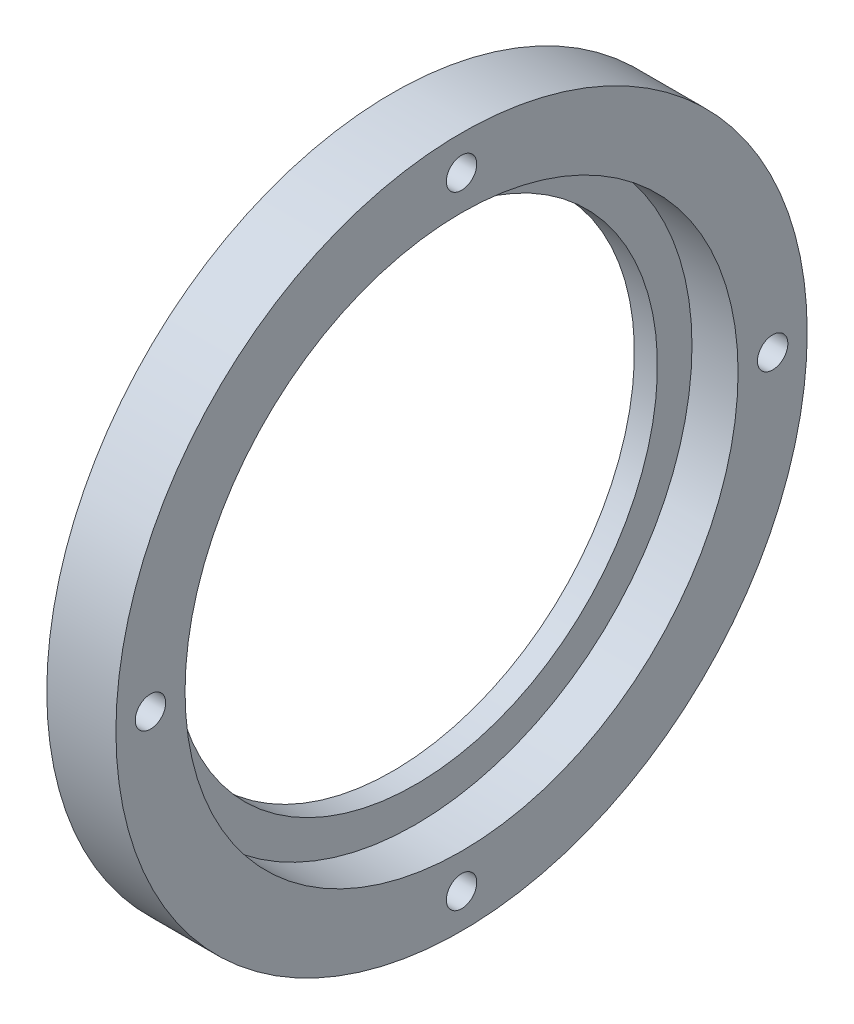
ISO-10303-21;
HEADER;
FILE_DESCRIPTION(('STEP AP214'),'2;1');
FILE_NAME('part.step','',(''),(''),'','','');
FILE_SCHEMA(('AUTOMOTIVE_DESIGN { 1 0 10303 214 1 1 1 1 }'));
ENDSEC;
DATA;
#1=APPLICATION_CONTEXT('core data for automotive mechanical design processes');
#2=APPLICATION_PROTOCOL_DEFINITION('international standard','automotive_design',2000,#1);
#3=PRODUCT_CONTEXT('',#1,'mechanical');
#4=PRODUCT('Part','Part','',(#3));
#5=PRODUCT_RELATED_PRODUCT_CATEGORY('part','',(#4));
#6=PRODUCT_DEFINITION_FORMATION('','',#4);
#7=PRODUCT_DEFINITION_CONTEXT('part definition',#1,'design');
#8=PRODUCT_DEFINITION('design','',#6,#7);
#9=PRODUCT_DEFINITION_SHAPE('','',#8);
#10=(LENGTH_UNIT() NAMED_UNIT(*) SI_UNIT(.MILLI.,.METRE.));
#11=(NAMED_UNIT(*) PLANE_ANGLE_UNIT() SI_UNIT($,.RADIAN.));
#12=(NAMED_UNIT(*) SI_UNIT($,.STERADIAN.) SOLID_ANGLE_UNIT());
#13=UNCERTAINTY_MEASURE_WITH_UNIT(LENGTH_MEASURE(1.E-05),#10,'distance_accuracy_value','');
#14=(GEOMETRIC_REPRESENTATION_CONTEXT(3) GLOBAL_UNCERTAINTY_ASSIGNED_CONTEXT((#13)) GLOBAL_UNIT_ASSIGNED_CONTEXT((#10,
#11,#12)) REPRESENTATION_CONTEXT('',''));
#15=CARTESIAN_POINT('',(0.,0.,0.));
#16=DIRECTION('',(0.,0.,1.));
#17=DIRECTION('',(1.,0.,0.));
#18=AXIS2_PLACEMENT_3D('',#15,#16,#17);
#19=CARTESIAN_POINT('',(-16.7088779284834,0.,0.));
#20=DIRECTION('',(-1.,0.,0.));
#21=DIRECTION('',(0.,0.,1.));
#22=AXIS2_PLACEMENT_3D('',#19,#20,#21);
#23=CYLINDRICAL_SURFACE('',#22,52.5);
#24=CARTESIAN_POINT('',(5.,0.,0.));
#25=DIRECTION('',(-1.,0.,0.));
#26=DIRECTION('',(0.,0.,1.));
#27=AXIS2_PLACEMENT_3D('',#24,#25,#26);
#28=CIRCLE('',#27,52.5);
#29=CARTESIAN_POINT('',(5.,0.,52.5));
#30=VERTEX_POINT('',#29);
#31=EDGE_CURVE('E52',#30,#30,#28,.T.);
#32=ORIENTED_EDGE('',*,*,#31,.F.);
#33=EDGE_LOOP('',(#32));
#34=FACE_BOUND('',#33,.T.);
#35=CARTESIAN_POINT('',(0.,0.,0.));
#36=DIRECTION('',(-1.,0.,0.));
#37=DIRECTION('',(0.,0.,1.));
#38=AXIS2_PLACEMENT_3D('',#35,#36,#37);
#39=CIRCLE('',#38,52.5);
#40=CARTESIAN_POINT('',(0.,0.,52.5));
#41=VERTEX_POINT('',#40);
#42=EDGE_CURVE('E10',#41,#41,#39,.T.);
#43=ORIENTED_EDGE('',*,*,#42,.T.);
#44=EDGE_LOOP('',(#43));
#45=FACE_BOUND('',#44,.T.);
#46=ADVANCED_FACE('F30',(#34,#45),#23,.F.);
#47=CARTESIAN_POINT('',(0.,52.5,0.));
#48=DIRECTION('',(1.,0.,0.));
#49=DIRECTION('',(0.,0.,-1.));
#50=AXIS2_PLACEMENT_3D('',#47,#48,#49);
#51=PLANE('',#50);
#52=CARTESIAN_POINT('',(0.,67.5,0.));
#53=DIRECTION('',(-1.,0.,0.));
#54=DIRECTION('',(0.,0.,1.));
#55=AXIS2_PLACEMENT_3D('',#52,#53,#54);
#56=CIRCLE('',#55,3.29999999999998);
#57=CARTESIAN_POINT('',(0.,67.5,3.29999999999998));
#58=VERTEX_POINT('',#57);
#59=EDGE_CURVE('E73',#58,#58,#56,.T.);
#60=ORIENTED_EDGE('',*,*,#59,.F.);
#61=EDGE_LOOP('',(#60));
#62=FACE_BOUND('',#61,.T.);
#63=CARTESIAN_POINT('',(0.,0.,67.5));
#64=DIRECTION('',(-1.,0.,0.));
#65=DIRECTION('',(0.,0.,1.));
#66=AXIS2_PLACEMENT_3D('',#63,#64,#65);
#67=CIRCLE('',#66,3.29999999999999);
#68=CARTESIAN_POINT('',(0.,0.,70.8));
#69=VERTEX_POINT('',#68);
#70=EDGE_CURVE('E67',#69,#69,#67,.T.);
#71=ORIENTED_EDGE('',*,*,#70,.F.);
#72=EDGE_LOOP('',(#71));
#73=FACE_BOUND('',#72,.T.);
#74=CARTESIAN_POINT('',(0.,-67.5,0.));
#75=DIRECTION('',(-1.,0.,0.));
#76=DIRECTION('',(0.,0.,1.));
#77=AXIS2_PLACEMENT_3D('',#74,#75,#76);
#78=CIRCLE('',#77,3.29999999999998);
#79=CARTESIAN_POINT('',(0.,-67.5,3.29999999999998));
#80=VERTEX_POINT('',#79);
#81=EDGE_CURVE('E61',#80,#80,#78,.T.);
#82=ORIENTED_EDGE('',*,*,#81,.F.);
#83=EDGE_LOOP('',(#82));
#84=FACE_BOUND('',#83,.T.);
#85=CARTESIAN_POINT('',(0.,0.,-67.5));
#86=DIRECTION('',(-1.,0.,0.));
#87=DIRECTION('',(0.,0.,1.));
#88=AXIS2_PLACEMENT_3D('',#85,#86,#87);
#89=CIRCLE('',#88,3.29999999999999);
#90=CARTESIAN_POINT('',(0.,0.,-64.2));
#91=VERTEX_POINT('',#90);
#92=EDGE_CURVE('E55',#91,#91,#89,.T.);
#93=ORIENTED_EDGE('',*,*,#92,.F.);
#94=EDGE_LOOP('',(#93));
#95=FACE_BOUND('',#94,.T.);
#96=ORIENTED_EDGE('',*,*,#42,.F.);
#97=EDGE_LOOP('',(#96));
#98=FACE_BOUND('',#97,.T.);
#99=CARTESIAN_POINT('',(0.,0.,0.));
#100=DIRECTION('',(-1.,0.,0.));
#101=DIRECTION('',(0.,0.,1.));
#102=AXIS2_PLACEMENT_3D('',#99,#100,#101);
#103=CIRCLE('',#102,75.);
#104=CARTESIAN_POINT('',(0.,0.,75.));
#105=VERTEX_POINT('',#104);
#106=EDGE_CURVE('E36',#105,#105,#103,.T.);
#107=ORIENTED_EDGE('',*,*,#106,.T.);
#108=EDGE_LOOP('',(#107));
#109=FACE_BOUND('',#108,.T.);
#110=ADVANCED_FACE('F90',(#62,#73,#84,#95,#98,#109),#51,.F.);
#111=CARTESIAN_POINT('',(-16.7088779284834,0.,0.));
#112=DIRECTION('',(-1.,0.,0.));
#113=DIRECTION('',(0.,0.,1.));
#114=AXIS2_PLACEMENT_3D('',#111,#112,#113);
#115=CYLINDRICAL_SURFACE('',#114,75.);
#116=ORIENTED_EDGE('',*,*,#106,.F.);
#117=EDGE_LOOP('',(#116));
#118=FACE_BOUND('',#117,.T.);
#119=CARTESIAN_POINT('',(15.,0.,0.));
#120=DIRECTION('',(-1.,0.,0.));
#121=DIRECTION('',(0.,0.,1.));
#122=AXIS2_PLACEMENT_3D('',#119,#120,#121);
#123=CIRCLE('',#122,75.);
#124=CARTESIAN_POINT('',(15.,0.,75.));
#125=VERTEX_POINT('',#124);
#126=EDGE_CURVE('E40',#125,#125,#123,.T.);
#127=ORIENTED_EDGE('',*,*,#126,.T.);
#128=EDGE_LOOP('',(#127));
#129=FACE_BOUND('',#128,.T.);
#130=ADVANCED_FACE('F93',(#118,#129),#115,.T.);
#131=CARTESIAN_POINT('',(15.,75.,0.));
#132=DIRECTION('',(-1.,0.,0.));
#133=DIRECTION('',(0.,0.,1.));
#134=AXIS2_PLACEMENT_3D('',#131,#132,#133);
#135=PLANE('',#134);
#136=CARTESIAN_POINT('',(15.,67.5,0.));
#137=DIRECTION('',(-1.,0.,0.));
#138=DIRECTION('',(0.,0.,1.));
#139=AXIS2_PLACEMENT_3D('',#136,#137,#138);
#140=CIRCLE('',#139,3.3);
#141=CARTESIAN_POINT('',(15.,67.5,3.3));
#142=VERTEX_POINT('',#141);
#143=EDGE_CURVE('E76',#142,#142,#140,.T.);
#144=ORIENTED_EDGE('',*,*,#143,.T.);
#145=EDGE_LOOP('',(#144));
#146=FACE_BOUND('',#145,.T.);
#147=CARTESIAN_POINT('',(15.,0.,67.5));
#148=DIRECTION('',(-1.,0.,0.));
#149=DIRECTION('',(0.,0.,1.));
#150=AXIS2_PLACEMENT_3D('',#147,#148,#149);
#151=CIRCLE('',#150,3.3);
#152=CARTESIAN_POINT('',(15.,0.,70.8));
#153=VERTEX_POINT('',#152);
#154=EDGE_CURVE('E70',#153,#153,#151,.T.);
#155=ORIENTED_EDGE('',*,*,#154,.T.);
#156=EDGE_LOOP('',(#155));
#157=FACE_BOUND('',#156,.T.);
#158=CARTESIAN_POINT('',(15.,-67.5,0.));
#159=DIRECTION('',(-1.,0.,0.));
#160=DIRECTION('',(0.,0.,1.));
#161=AXIS2_PLACEMENT_3D('',#158,#159,#160);
#162=CIRCLE('',#161,3.3);
#163=CARTESIAN_POINT('',(15.,-67.5,3.3));
#164=VERTEX_POINT('',#163);
#165=EDGE_CURVE('E64',#164,#164,#162,.T.);
#166=ORIENTED_EDGE('',*,*,#165,.T.);
#167=EDGE_LOOP('',(#166));
#168=FACE_BOUND('',#167,.T.);
#169=CARTESIAN_POINT('',(15.,0.,-67.5));
#170=DIRECTION('',(-1.,0.,0.));
#171=DIRECTION('',(0.,0.,1.));
#172=AXIS2_PLACEMENT_3D('',#169,#170,#171);
#173=CIRCLE('',#172,3.3);
#174=CARTESIAN_POINT('',(15.,0.,-64.2));
#175=VERTEX_POINT('',#174);
#176=EDGE_CURVE('E58',#175,#175,#173,.T.);
#177=ORIENTED_EDGE('',*,*,#176,.T.);
#178=EDGE_LOOP('',(#177));
#179=FACE_BOUND('',#178,.T.);
#180=ORIENTED_EDGE('',*,*,#126,.F.);
#181=EDGE_LOOP('',(#180));
#182=FACE_BOUND('',#181,.T.);
#183=CARTESIAN_POINT('',(15.,0.,0.));
#184=DIRECTION('',(-1.,0.,0.));
#185=DIRECTION('',(0.,0.,1.));
#186=AXIS2_PLACEMENT_3D('',#183,#184,#185);
#187=CIRCLE('',#186,60.);
#188=CARTESIAN_POINT('',(15.,0.,60.));
#189=VERTEX_POINT('',#188);
#190=EDGE_CURVE('E44',#189,#189,#187,.T.);
#191=ORIENTED_EDGE('',*,*,#190,.T.);
#192=EDGE_LOOP('',(#191));
#193=FACE_BOUND('',#192,.T.);
#194=ADVANCED_FACE('F80',(#146,#157,#168,#179,#182,#193),#135,.F.);
#195=CARTESIAN_POINT('',(-16.7088779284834,0.,0.));
#196=DIRECTION('',(-1.,0.,0.));
#197=DIRECTION('',(0.,0.,1.));
#198=AXIS2_PLACEMENT_3D('',#195,#196,#197);
#199=CYLINDRICAL_SURFACE('',#198,60.);
#200=ORIENTED_EDGE('',*,*,#190,.F.);
#201=EDGE_LOOP('',(#200));
#202=FACE_BOUND('',#201,.T.);
#203=CARTESIAN_POINT('',(5.,0.,0.));
#204=DIRECTION('',(-1.,0.,0.));
#205=DIRECTION('',(0.,0.,1.));
#206=AXIS2_PLACEMENT_3D('',#203,#204,#205);
#207=CIRCLE('',#206,60.);
#208=CARTESIAN_POINT('',(5.,0.,60.));
#209=VERTEX_POINT('',#208);
#210=EDGE_CURVE('E49',#209,#209,#207,.T.);
#211=ORIENTED_EDGE('',*,*,#210,.T.);
#212=EDGE_LOOP('',(#211));
#213=FACE_BOUND('',#212,.T.);
#214=ADVANCED_FACE('F113',(#202,#213),#199,.F.);
#215=CARTESIAN_POINT('',(5.,60.,0.));
#216=DIRECTION('',(-1.,0.,0.));
#217=DIRECTION('',(0.,0.,1.));
#218=AXIS2_PLACEMENT_3D('',#215,#216,#217);
#219=PLANE('',#218);
#220=ORIENTED_EDGE('',*,*,#210,.F.);
#221=EDGE_LOOP('',(#220));
#222=FACE_BOUND('',#221,.T.);
#223=ORIENTED_EDGE('',*,*,#31,.T.);
#224=EDGE_LOOP('',(#223));
#225=FACE_BOUND('',#224,.T.);
#226=ADVANCED_FACE('F104',(#222,#225),#219,.F.);
#227=CARTESIAN_POINT('',(0.,0.,-67.5));
#228=DIRECTION('',(-1.,0.,0.));
#229=DIRECTION('',(0.,0.,1.));
#230=AXIS2_PLACEMENT_3D('',#227,#228,#229);
#231=CYLINDRICAL_SURFACE('',#230,3.29999999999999);
#232=ORIENTED_EDGE('',*,*,#176,.F.);
#233=EDGE_LOOP('',(#232));
#234=FACE_BOUND('',#233,.T.);
#235=ORIENTED_EDGE('',*,*,#92,.T.);
#236=EDGE_LOOP('',(#235));
#237=FACE_BOUND('',#236,.T.);
#238=ADVANCED_FACE('F101',(#234,#237),#231,.F.);
#239=CARTESIAN_POINT('',(0.,-67.5,0.));
#240=DIRECTION('',(-1.,0.,0.));
#241=DIRECTION('',(0.,0.,1.));
#242=AXIS2_PLACEMENT_3D('',#239,#240,#241);
#243=CYLINDRICAL_SURFACE('',#242,3.29999999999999);
#244=ORIENTED_EDGE('',*,*,#165,.F.);
#245=EDGE_LOOP('',(#244));
#246=FACE_BOUND('',#245,.T.);
#247=ORIENTED_EDGE('',*,*,#81,.T.);
#248=EDGE_LOOP('',(#247));
#249=FACE_BOUND('',#248,.T.);
#250=ADVANCED_FACE('F103',(#246,#249),#243,.F.);
#251=CARTESIAN_POINT('',(0.,0.,67.5));
#252=DIRECTION('',(-1.,0.,0.));
#253=DIRECTION('',(0.,0.,1.));
#254=AXIS2_PLACEMENT_3D('',#251,#252,#253);
#255=CYLINDRICAL_SURFACE('',#254,3.29999999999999);
#256=ORIENTED_EDGE('',*,*,#154,.F.);
#257=EDGE_LOOP('',(#256));
#258=FACE_BOUND('',#257,.T.);
#259=ORIENTED_EDGE('',*,*,#70,.T.);
#260=EDGE_LOOP('',(#259));
#261=FACE_BOUND('',#260,.T.);
#262=ADVANCED_FACE('F86',(#258,#261),#255,.F.);
#263=CARTESIAN_POINT('',(0.,67.5,0.));
#264=DIRECTION('',(-1.,0.,0.));
#265=DIRECTION('',(0.,0.,1.));
#266=AXIS2_PLACEMENT_3D('',#263,#264,#265);
#267=CYLINDRICAL_SURFACE('',#266,3.29999999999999);
#268=ORIENTED_EDGE('',*,*,#143,.F.);
#269=EDGE_LOOP('',(#268));
#270=FACE_BOUND('',#269,.T.);
#271=ORIENTED_EDGE('',*,*,#59,.T.);
#272=EDGE_LOOP('',(#271));
#273=FACE_BOUND('',#272,.T.);
#274=ADVANCED_FACE('F83',(#270,#273),#267,.F.);
#275=CLOSED_SHELL('',(#46,#110,#130,#194,#214,#226,#238,#250,#262,#274));
#276=MANIFOLD_SOLID_BREP('B2',#275);
#277=ADVANCED_BREP_SHAPE_REPRESENTATION('',(#18,#276),#14);
#278=SHAPE_DEFINITION_REPRESENTATION(#9,#277);
ENDSEC;
END-ISO-10303-21;
